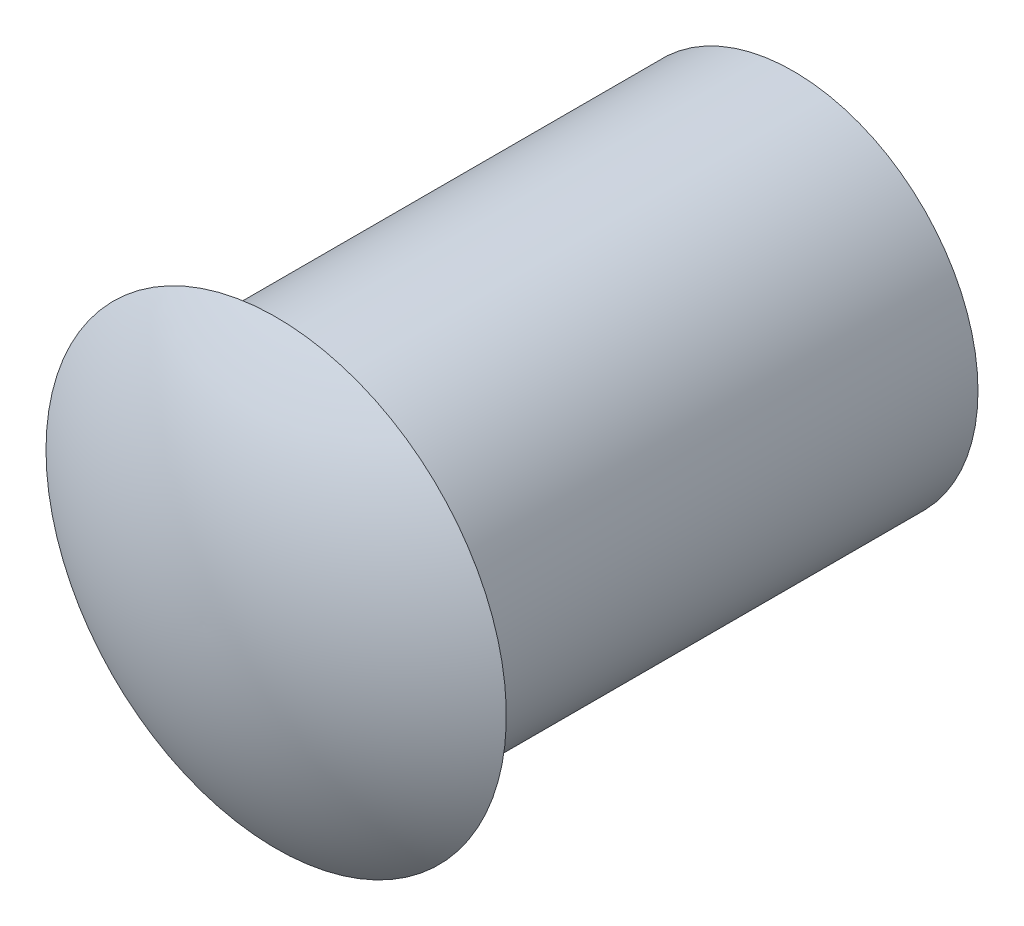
from build123d import *

# Parameters (mm, degrees)
SKETCH1_R           = 2.992510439
BOSS_EXTRUDE1_DEPTH = 8.382


with BuildPart() as part:
    # Sketch1 → Boss-Extrude1 (new body)
    with BuildSketch(Plane.XY):
        Circle(SKETCH1_R)
    extrude(amount=-BOSS_EXTRUDE1_DEPTH)

    # Sketch2 → Revolve1 (revolve)
    with BuildSketch(Plane(origin=(0, 0, 0), x_dir=(1, 0, 0), z_dir=(0, 1, 0))):
        with BuildLine():
            Line((-3.730319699, 0), (0, 0))
            Line((0, 0), (0, -1.180813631))
            ThreePointArc((0, -1.180813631), (-1.958531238, -0.885377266), (-3.730319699, 0))
        make_face()
    revolve(axis=Axis((0, 0, 0), (0, 0, 1)))


solid = part.part
